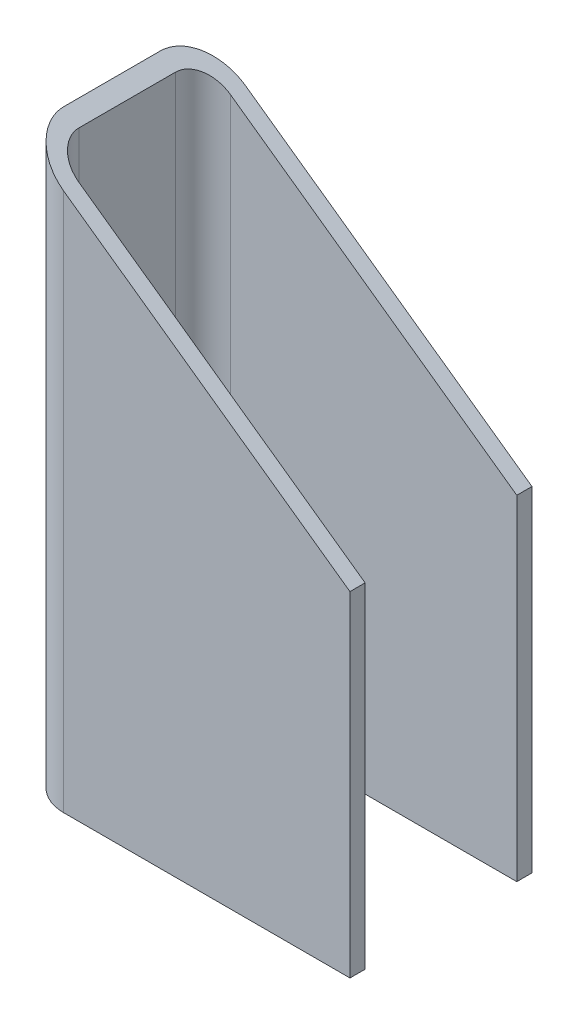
from build123d import *

# Parameters (mm, degrees)
SALIENTE_EXTRUIR1_DEPTH = 300
CORTAR_EXTRUIR1_DEPTH   = 300


with BuildPart() as part:
    # Croquis2 → Saliente-Extruir1 (new body)
    with BuildSketch(Plane(origin=(0, 0, 0), x_dir=(1, 0, 0), z_dir=(0, 1, 0))):
        with BuildLine():
            Line((-75.5, 40), (75.5, 40))
            Line((75.5, 40), (75.5, 48))
            Line((75.5, 48), (-75.5, 48))
            ThreePointArc((-75.5, 48), (-91.409902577, 41.409902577), (-98, 25.5))
            Line((-98, 25.5), (-98, -25.5))
            ThreePointArc((-98, -25.5), (-91.409902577, -41.409902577), (-75.5, -48))
            Line((-75.5, -48), (75.5, -48))
            Line((75.5, -48), (75.5, -40))
            Line((75.5, -40), (-75.5, -40))
            ThreePointArc((-75.5, -40), (-85.753048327, -35.753048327), (-90, -25.5))
            Line((-90, -25.5), (-90, 25.5))
            ThreePointArc((-90, 25.5), (-85.753048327, 35.753048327), (-75.5, 40))
        make_face()
    extrude(amount=SALIENTE_EXTRUIR1_DEPTH)

    # Croquis3 → Cortar-Extruir1 (cut)
    with BuildSketch(Plane.XY.offset(48)):
        Polygon((-98, 300), (75.5, 176.516953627), (75.5, 300), align=None)
    extrude(amount=-CORTAR_EXTRUIR1_DEPTH, mode=Mode.SUBTRACT)


solid = part.part
